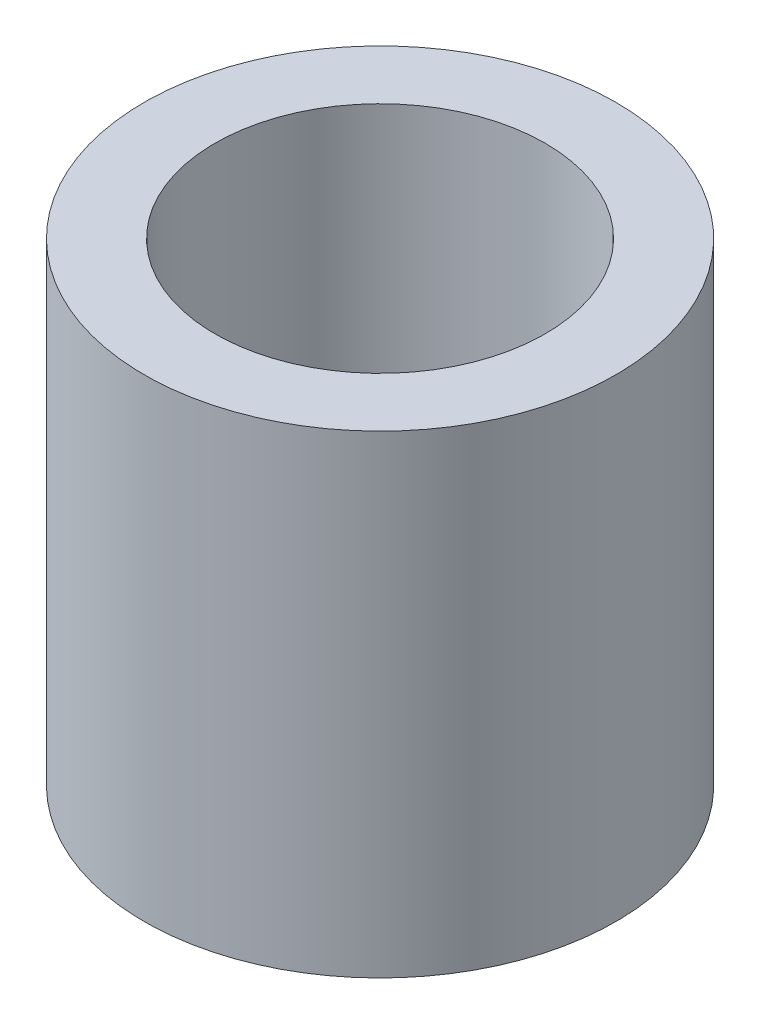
from build123d import *

# Parameters (mm, degrees)
ESQUISSE1_W = 6
ESQUISSE1_H = 40.15


with BuildPart() as part:
    # Esquisse1 → R_volution1 (revolve)
    with BuildSketch(Plane.XY, mode=Mode.PRIVATE) as r_volution1_sk:
        with Locations((17, 20.075)):
            Rectangle(ESQUISSE1_W, ESQUISSE1_H)
    revolve(r_volution1_sk.sketch.rotate(Axis((0, 0, 0), (0, 1, 0)), 90), axis=Axis((0, 0, 0), (0, 1, 0)))


solid = part.part
